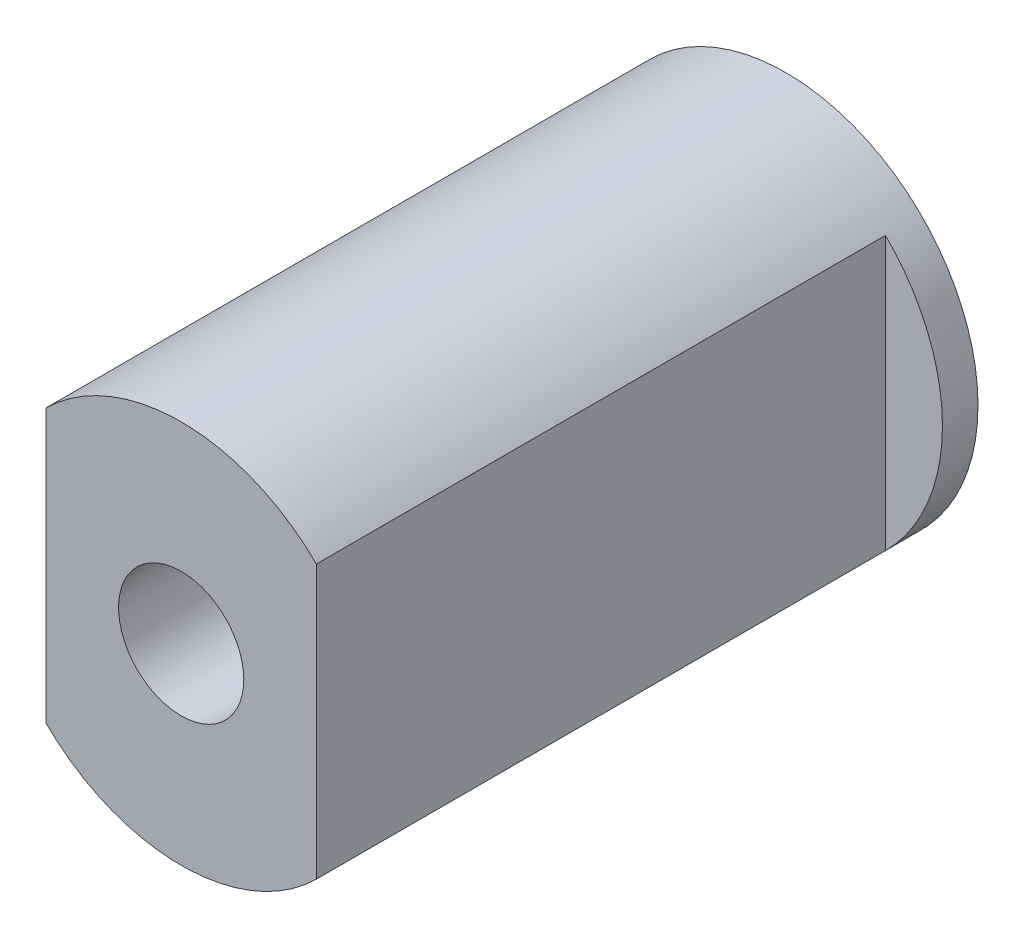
ISO-10303-21;
HEADER;
FILE_DESCRIPTION(('STEP AP214'),'2;1');
FILE_NAME('part.step','',(''),(''),'','','');
FILE_SCHEMA(('AUTOMOTIVE_DESIGN { 1 0 10303 214 1 1 1 1 }'));
ENDSEC;
DATA;
#1=APPLICATION_CONTEXT('core data for automotive mechanical design processes');
#2=APPLICATION_PROTOCOL_DEFINITION('international standard','automotive_design',2000,#1);
#3=PRODUCT_CONTEXT('',#1,'mechanical');
#4=PRODUCT('Part','Part','',(#3));
#5=PRODUCT_RELATED_PRODUCT_CATEGORY('part','',(#4));
#6=PRODUCT_DEFINITION_FORMATION('','',#4);
#7=PRODUCT_DEFINITION_CONTEXT('part definition',#1,'design');
#8=PRODUCT_DEFINITION('design','',#6,#7);
#9=PRODUCT_DEFINITION_SHAPE('','',#8);
#10=(LENGTH_UNIT() NAMED_UNIT(*) SI_UNIT(.MILLI.,.METRE.));
#11=(NAMED_UNIT(*) PLANE_ANGLE_UNIT() SI_UNIT($,.RADIAN.));
#12=(NAMED_UNIT(*) SI_UNIT($,.STERADIAN.) SOLID_ANGLE_UNIT());
#13=UNCERTAINTY_MEASURE_WITH_UNIT(LENGTH_MEASURE(1.E-05),#10,'distance_accuracy_value','');
#14=(GEOMETRIC_REPRESENTATION_CONTEXT(3) GLOBAL_UNCERTAINTY_ASSIGNED_CONTEXT((#13)) GLOBAL_UNIT_ASSIGNED_CONTEXT((#10,
#11,#12)) REPRESENTATION_CONTEXT('',''));
#15=CARTESIAN_POINT('',(0.,0.,0.));
#16=DIRECTION('',(0.,0.,1.));
#17=DIRECTION('',(1.,0.,0.));
#18=AXIS2_PLACEMENT_3D('',#15,#16,#17);
#19=CARTESIAN_POINT('',(0.,0.,0.5));
#20=DIRECTION('',(0.,0.,1.));
#21=DIRECTION('',(1.,0.,0.));
#22=AXIS2_PLACEMENT_3D('',#19,#20,#21);
#23=PLANE('',#22);
#24=DIRECTION('',(0.,-1.,0.));
#25=VECTOR('',#24,1.);
#26=CARTESIAN_POINT('',(-1.9,-1.91833260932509,0.5));
#27=LINE('',#26,#25);
#28=CARTESIAN_POINT('',(-1.9,1.91833260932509,0.5));
#29=VERTEX_POINT('',#28);
#30=CARTESIAN_POINT('',(-1.9,-1.91833260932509,0.5));
#31=VERTEX_POINT('',#30);
#32=EDGE_CURVE('E99',#29,#31,#27,.T.);
#33=ORIENTED_EDGE('',*,*,#32,.F.);
#34=CARTESIAN_POINT('',(0.,0.,0.5));
#35=DIRECTION('',(0.,0.,1.));
#36=DIRECTION('',(1.,0.,0.));
#37=AXIS2_PLACEMENT_3D('',#34,#35,#36);
#38=CIRCLE('',#37,2.7);
#39=EDGE_CURVE('E11',#29,#31,#38,.T.);
#40=ORIENTED_EDGE('',*,*,#39,.T.);
#41=EDGE_LOOP('',(#33,#40));
#42=FACE_BOUND('',#41,.T.);
#43=ADVANCED_FACE('F39',(#42),#23,.T.);
#44=CARTESIAN_POINT('',(0.,0.,0.5));
#45=DIRECTION('',(0.,0.,-1.));
#46=DIRECTION('',(-1.,0.,0.));
#47=AXIS2_PLACEMENT_3D('',#44,#45,#46);
#48=CYLINDRICAL_SURFACE('',#47,2.7);
#49=ORIENTED_EDGE('',*,*,#39,.F.);
#50=DIRECTION('',(0.,0.,-1.));
#51=VECTOR('',#50,1.);
#52=CARTESIAN_POINT('',(-1.9,1.91833260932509,8.5));
#53=LINE('',#52,#51);
#54=CARTESIAN_POINT('',(-1.9,1.91833260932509,8.5));
#55=VERTEX_POINT('',#54);
#56=EDGE_CURVE('E106',#55,#29,#53,.T.);
#57=ORIENTED_EDGE('',*,*,#56,.F.);
#58=CARTESIAN_POINT('',(0.,0.,8.5));
#59=DIRECTION('',(0.,0.,1.));
#60=DIRECTION('',(1.,0.,0.));
#61=AXIS2_PLACEMENT_3D('',#58,#59,#60);
#62=CIRCLE('',#61,2.7);
#63=CARTESIAN_POINT('',(1.9,1.91833260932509,8.5));
#64=VERTEX_POINT('',#63);
#65=EDGE_CURVE('E89',#64,#55,#62,.T.);
#66=ORIENTED_EDGE('',*,*,#65,.F.);
#67=DIRECTION('',(0.,0.,-1.));
#68=VECTOR('',#67,1.);
#69=CARTESIAN_POINT('',(1.9,1.91833260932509,8.5));
#70=LINE('',#69,#68);
#71=CARTESIAN_POINT('',(1.9,1.91833260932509,0.5));
#72=VERTEX_POINT('',#71);
#73=EDGE_CURVE('E86',#64,#72,#70,.T.);
#74=ORIENTED_EDGE('',*,*,#73,.T.);
#75=CARTESIAN_POINT('',(1.9,-1.91833260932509,0.5));
#76=VERTEX_POINT('',#75);
#77=EDGE_CURVE('E48',#76,#72,#38,.T.);
#78=ORIENTED_EDGE('',*,*,#77,.F.);
#79=DIRECTION('',(0.,0.,-1.));
#80=VECTOR('',#79,1.);
#81=CARTESIAN_POINT('',(1.9,-1.91833260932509,8.5));
#82=LINE('',#81,#80);
#83=CARTESIAN_POINT('',(1.9,-1.91833260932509,8.5));
#84=VERTEX_POINT('',#83);
#85=EDGE_CURVE('E84',#84,#76,#82,.T.);
#86=ORIENTED_EDGE('',*,*,#85,.F.);
#87=CARTESIAN_POINT('',(0.,0.,8.5));
#88=DIRECTION('',(0.,0.,1.));
#89=DIRECTION('',(1.,0.,0.));
#90=AXIS2_PLACEMENT_3D('',#87,#88,#89);
#91=CIRCLE('',#90,2.7);
#92=CARTESIAN_POINT('',(-1.9,-1.91833260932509,8.5));
#93=VERTEX_POINT('',#92);
#94=EDGE_CURVE('E90',#93,#84,#91,.T.);
#95=ORIENTED_EDGE('',*,*,#94,.F.);
#96=DIRECTION('',(0.,0.,-1.));
#97=VECTOR('',#96,1.);
#98=CARTESIAN_POINT('',(-1.9,-1.91833260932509,8.5));
#99=LINE('',#98,#97);
#100=EDGE_CURVE('E115',#93,#31,#99,.T.);
#101=ORIENTED_EDGE('',*,*,#100,.T.);
#102=EDGE_LOOP('',(#49,#57,#66,#74,#78,#86,#95,#101));
#103=FACE_BOUND('',#102,.T.);
#104=CARTESIAN_POINT('',(0.,0.,0.));
#105=DIRECTION('',(0.,0.,1.));
#106=DIRECTION('',(1.,0.,0.));
#107=AXIS2_PLACEMENT_3D('',#104,#105,#106);
#108=CIRCLE('',#107,2.7);
#109=CARTESIAN_POINT('',(2.7,0.,0.));
#110=VERTEX_POINT('',#109);
#111=EDGE_CURVE('E102',#110,#110,#108,.T.);
#112=ORIENTED_EDGE('',*,*,#111,.T.);
#113=EDGE_LOOP('',(#112));
#114=FACE_BOUND('',#113,.T.);
#115=ADVANCED_FACE('F41',(#103,#114),#48,.T.);
#116=DIRECTION('',(0.,1.,0.));
#117=VECTOR('',#116,1.);
#118=CARTESIAN_POINT('',(1.9,-1.91833260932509,0.5));
#119=LINE('',#118,#117);
#120=EDGE_CURVE('E55',#76,#72,#119,.T.);
#121=ORIENTED_EDGE('',*,*,#120,.F.);
#122=ORIENTED_EDGE('',*,*,#77,.T.);
#123=EDGE_LOOP('',(#121,#122));
#124=FACE_BOUND('',#123,.T.);
#125=ADVANCED_FACE('F142',(#124),#23,.T.);
#126=CARTESIAN_POINT('',(0.,0.,0.));
#127=DIRECTION('',(0.,0.,1.));
#128=DIRECTION('',(1.,0.,0.));
#129=AXIS2_PLACEMENT_3D('',#126,#127,#128);
#130=PLANE('',#129);
#131=CARTESIAN_POINT('',(0.,0.,0.));
#132=DIRECTION('',(0.,0.,1.));
#133=DIRECTION('',(1.,0.,0.));
#134=AXIS2_PLACEMENT_3D('',#131,#132,#133);
#135=CIRCLE('',#134,0.88);
#136=CARTESIAN_POINT('',(0.88,0.,0.));
#137=VERTEX_POINT('',#136);
#138=EDGE_CURVE('E126',#137,#137,#135,.F.);
#139=ORIENTED_EDGE('',*,*,#138,.F.);
#140=EDGE_LOOP('',(#139));
#141=FACE_BOUND('',#140,.T.);
#142=ORIENTED_EDGE('',*,*,#111,.F.);
#143=EDGE_LOOP('',(#142));
#144=FACE_BOUND('',#143,.T.);
#145=ADVANCED_FACE('F148',(#141,#144),#130,.F.);
#146=CARTESIAN_POINT('',(1.9,-1.91833260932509,8.5));
#147=DIRECTION('',(-1.,0.,0.));
#148=DIRECTION('',(0.,0.,1.));
#149=AXIS2_PLACEMENT_3D('',#146,#147,#148);
#150=PLANE('',#149);
#151=ORIENTED_EDGE('',*,*,#120,.T.);
#152=ORIENTED_EDGE('',*,*,#73,.F.);
#153=DIRECTION('',(0.,1.,0.));
#154=VECTOR('',#153,1.);
#155=CARTESIAN_POINT('',(1.9,-1.91833260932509,8.5));
#156=LINE('',#155,#154);
#157=EDGE_CURVE('E80',#84,#64,#156,.T.);
#158=ORIENTED_EDGE('',*,*,#157,.F.);
#159=ORIENTED_EDGE('',*,*,#85,.T.);
#160=EDGE_LOOP('',(#151,#152,#158,#159));
#161=FACE_BOUND('',#160,.T.);
#162=ADVANCED_FACE('F82',(#161),#150,.F.);
#163=CARTESIAN_POINT('',(-1.9,-1.91833260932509,8.5));
#164=DIRECTION('',(1.,0.,0.));
#165=DIRECTION('',(0.,0.,-1.));
#166=AXIS2_PLACEMENT_3D('',#163,#164,#165);
#167=PLANE('',#166);
#168=ORIENTED_EDGE('',*,*,#32,.T.);
#169=ORIENTED_EDGE('',*,*,#100,.F.);
#170=DIRECTION('',(0.,-1.,0.));
#171=VECTOR('',#170,1.);
#172=CARTESIAN_POINT('',(-1.9,-1.91833260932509,8.5));
#173=LINE('',#172,#171);
#174=EDGE_CURVE('E95',#55,#93,#173,.T.);
#175=ORIENTED_EDGE('',*,*,#174,.F.);
#176=ORIENTED_EDGE('',*,*,#56,.T.);
#177=EDGE_LOOP('',(#168,#169,#175,#176));
#178=FACE_BOUND('',#177,.T.);
#179=ADVANCED_FACE('F139',(#178),#167,.F.);
#180=CARTESIAN_POINT('',(0.,0.,8.5));
#181=DIRECTION('',(0.,0.,1.));
#182=DIRECTION('',(1.,0.,0.));
#183=AXIS2_PLACEMENT_3D('',#180,#181,#182);
#184=PLANE('',#183);
#185=CARTESIAN_POINT('',(0.,0.,8.5));
#186=DIRECTION('',(0.,0.,1.));
#187=DIRECTION('',(1.,0.,0.));
#188=AXIS2_PLACEMENT_3D('',#185,#186,#187);
#189=CIRCLE('',#188,0.88);
#190=CARTESIAN_POINT('',(0.88,0.,8.5));
#191=VERTEX_POINT('',#190);
#192=EDGE_CURVE('E128',#191,#191,#189,.T.);
#193=ORIENTED_EDGE('',*,*,#192,.F.);
#194=EDGE_LOOP('',(#193));
#195=FACE_BOUND('',#194,.T.);
#196=ORIENTED_EDGE('',*,*,#94,.T.);
#197=ORIENTED_EDGE('',*,*,#157,.T.);
#198=ORIENTED_EDGE('',*,*,#65,.T.);
#199=ORIENTED_EDGE('',*,*,#174,.T.);
#200=EDGE_LOOP('',(#196,#197,#198,#199));
#201=FACE_BOUND('',#200,.T.);
#202=ADVANCED_FACE('F93',(#195,#201),#184,.T.);
#203=CARTESIAN_POINT('',(0.,0.,-2.48901586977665));
#204=DIRECTION('',(0.,0.,1.));
#205=DIRECTION('',(1.,0.,0.));
#206=AXIS2_PLACEMENT_3D('',#203,#204,#205);
#207=CYLINDRICAL_SURFACE('',#206,0.88);
#208=ORIENTED_EDGE('',*,*,#138,.T.);
#209=EDGE_LOOP('',(#208));
#210=FACE_BOUND('',#209,.T.);
#211=ORIENTED_EDGE('',*,*,#192,.T.);
#212=EDGE_LOOP('',(#211));
#213=FACE_BOUND('',#212,.T.);
#214=ADVANCED_FACE('F165',(#210,#213),#207,.F.);
#215=CLOSED_SHELL('',(#43,#115,#125,#145,#162,#179,#202,#214));
#216=MANIFOLD_SOLID_BREP('B2',#215);
#217=ADVANCED_BREP_SHAPE_REPRESENTATION('',(#18,#216),#14);
#218=SHAPE_DEFINITION_REPRESENTATION(#9,#217);
ENDSEC;
END-ISO-10303-21;
